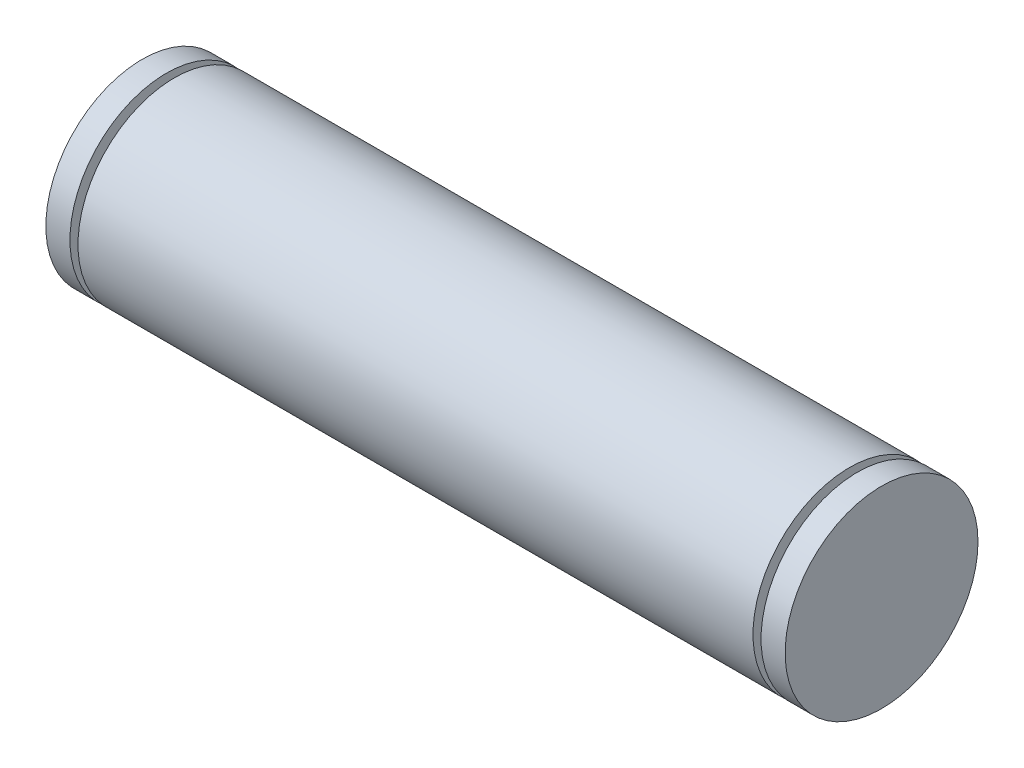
from build123d import *

# Parameters (mm, degrees)
SKETCH1_R               = 9.525
BOSS_EXTRUDE1_DEPTH     = 36.5125
CUT_EXTRUDE_THIN1_START = -33.3375
SKETCH1_3_R             = 9.525
SKETCH1_3_R_2           = 7.62
CUT_EXTRUDE_THIN1_DEPTH = 0.79375


with BuildPart() as part:
    # Sketch1 → Boss-Extrude1 (new, symmetric)
    with BuildSketch(Plane(origin=(0, 0, 0), x_dir=(0, 0, -1), z_dir=(1, 0, 0))):
        Circle(SKETCH1_R)
    extrude(amount=BOSS_EXTRUDE1_DEPTH, both=True)

    # Sketch1_3 → Cut-Extrude-Thin1 (cut)
    with BuildSketch(Plane(origin=(0, 0, 0), x_dir=(0, 0, -1), z_dir=(1, 0, 0)).offset(CUT_EXTRUDE_THIN1_START)):
        Circle(SKETCH1_3_R)
        Circle(SKETCH1_3_R_2, mode=Mode.SUBTRACT)
    cut_extrude_thin1 = extrude(amount=-CUT_EXTRUDE_THIN1_DEPTH, mode=Mode.SUBTRACT)

    # Mirror1: Cut-Extrude-Thin1 across plane
    add(cut_extrude_thin1.mirror(Plane(origin=(0, 0, 0), x_dir=(0, 0, 1), z_dir=(1, 0, 0))), mode=Mode.SUBTRACT)


solid = part.part
